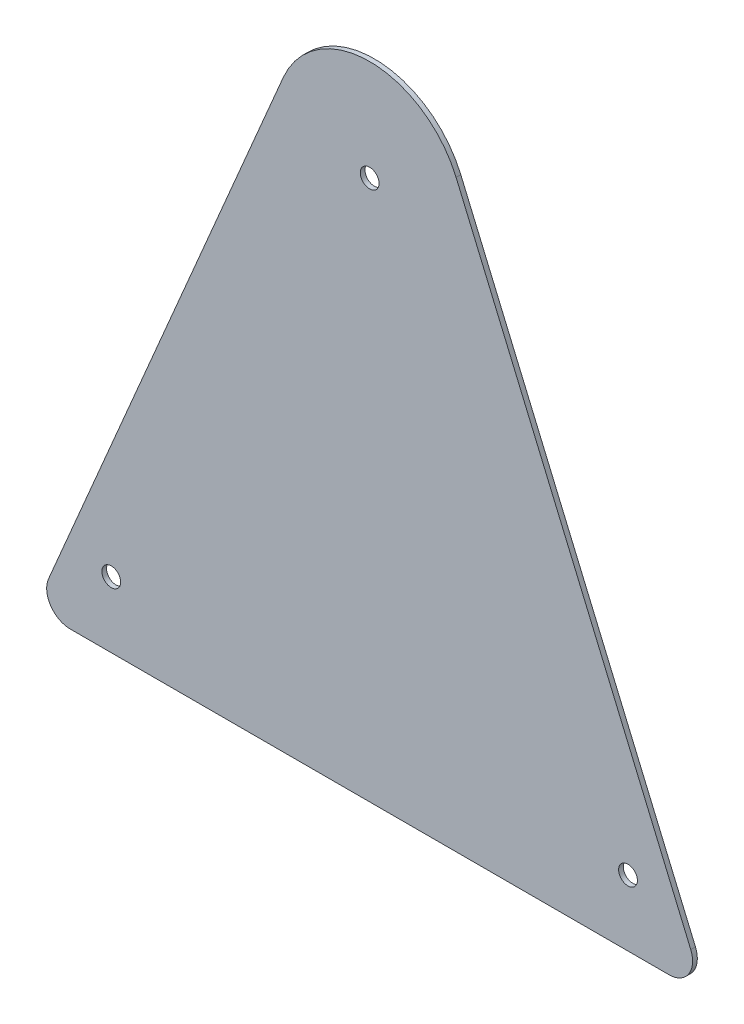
from build123d import *

# Parameters (mm, degrees)
ESQUISSE1_R          = 4
BASE_EXTRUSION_DEPTH = 1


with BuildPart() as part:
    # Esquisse1 → Base-Extrusion (new, symmetric)
    with BuildSketch(Plane.XY):
        with BuildLine():
            Line((-127.5, 0), (127.5, 0))
            ThreePointArc((127.5, 0), (135.841359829, 4.484411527), (136.701501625, 13.915656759))
            Line((136.701501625, 13.915656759), (36.806006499, 248.662627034))
            ThreePointArc((36.806006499, 248.662627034), (0, 273), (-36.806006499, 248.662627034))
            Line((-36.806006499, 248.662627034), (-136.701501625, 13.915656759))
            ThreePointArc((-136.701501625, 13.915656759), (-135.841359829, 4.484411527), (-127.5, 0))
        make_face()
        with Locations((0, 230)):
            Circle(ESQUISSE1_R, mode=Mode.SUBTRACT)
        with Locations((-110, 28.009901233)):
            Circle(ESQUISSE1_R, mode=Mode.SUBTRACT)
        with Locations((110, 28.009901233)):
            Circle(ESQUISSE1_R, mode=Mode.SUBTRACT)
    extrude(amount=BASE_EXTRUSION_DEPTH, both=True)


solid = part.part
